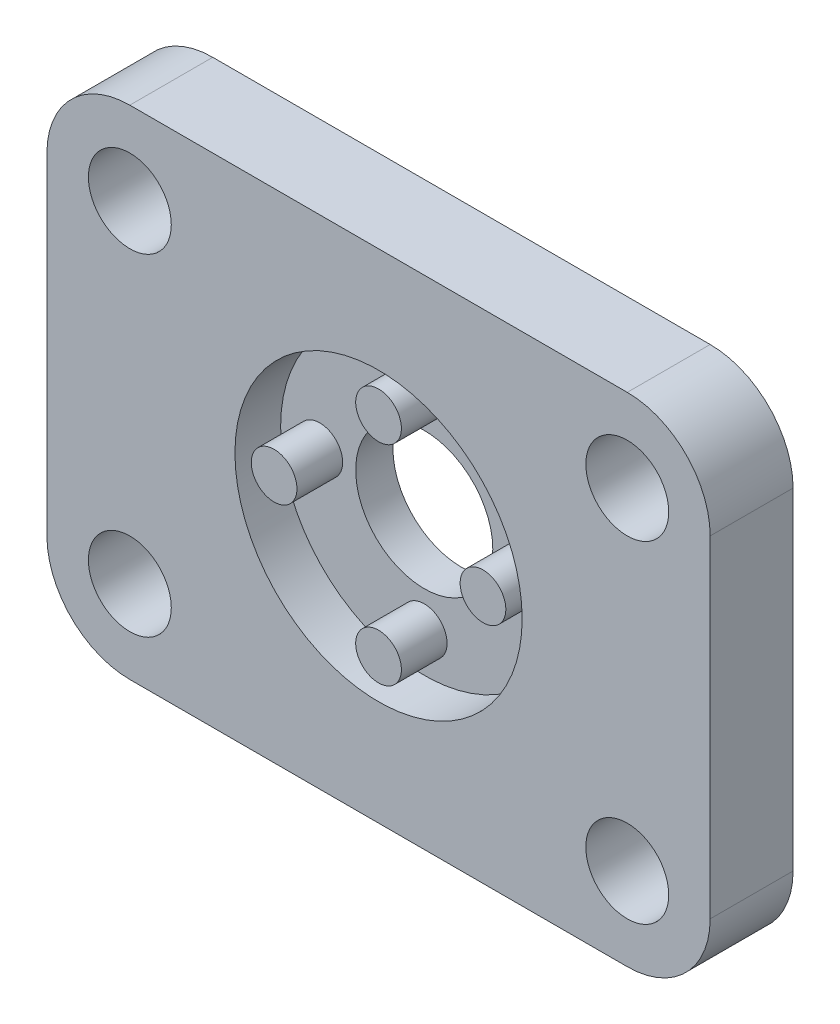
from build123d import *

# Parameters (mm, degrees)
SKETCH1_W           = 50.8
SKETCH1_H           = 38.1
BOSS_EXTRUDE1_DEPTH = 6.35
SKETCH2_R           = 11
SKETCH2_R_2         = 1.75
CUT_EXTRUDE1_DEPTH  = 3.5
SKETCH3_R           = 5.25
CUT_EXTRUDE2_DEPTH  = 3.5
SKETCH4_R           = 3.175
CUT_EXTRUDE3_DEPTH  = 64.816710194
FILLET1_R           = 6.35


with BuildPart() as part:
    # Sketch1 → Boss-Extrude1 (new body)
    with BuildSketch(Plane.XY):
        with Locations((25.4, 19.05)):
            Rectangle(SKETCH1_W, SKETCH1_H)
    extrude(amount=BOSS_EXTRUDE1_DEPTH)

    # Sketch2 → Cut-Extrude1 (cut)
    with BuildSketch(Plane.XY.offset(6.35)):
        with Locations((25.4, 19.05)):
            Circle(SKETCH2_R)
        with Locations((25.4, 27.05)):
            Circle(SKETCH2_R_2, mode=Mode.SUBTRACT)
        with Locations((33.4, 19.05)):
            Circle(SKETCH2_R_2, mode=Mode.SUBTRACT)
        with Locations((25.4, 11.05)):
            Circle(SKETCH2_R_2, mode=Mode.SUBTRACT)
        with Locations((17.4, 19.05)):
            Circle(SKETCH2_R_2, mode=Mode.SUBTRACT)
    extrude(amount=-CUT_EXTRUDE1_DEPTH, mode=Mode.SUBTRACT)

    # Sketch3 → Cut-Extrude2 (cut)
    with BuildSketch(Plane.XY.offset(2.85)):
        with Locations((25.4, 19.05)):
            Circle(SKETCH3_R)
    extrude(amount=-CUT_EXTRUDE2_DEPTH, mode=Mode.SUBTRACT)

    # Sketch4 → Cut-Extrude3 (cut, through all)
    with BuildSketch(Plane.XY.offset(6.35)):
        with Locations((6.35, 31.75)):
            Circle(SKETCH4_R)
        with Locations((6.35, 6.35)):
            Circle(SKETCH4_R)
        with Locations((44.45, 31.75)):
            Circle(SKETCH4_R)
        with Locations((44.45, 6.35)):
            Circle(SKETCH4_R)
    extrude(amount=-CUT_EXTRUDE3_DEPTH, mode=Mode.SUBTRACT)

    # Fillet1
    fillet1_edges = [part.edges().sort_by_distance(p)[0] for p in [
        (0, 38.1, 3.175),
        (50.8, 38.1, 3.175),
        (50.8, 0, 3.175),
        (0, 0, 3.175),
    ]]
    fillet(fillet1_edges, radius=FILLET1_R)


solid = part.part
